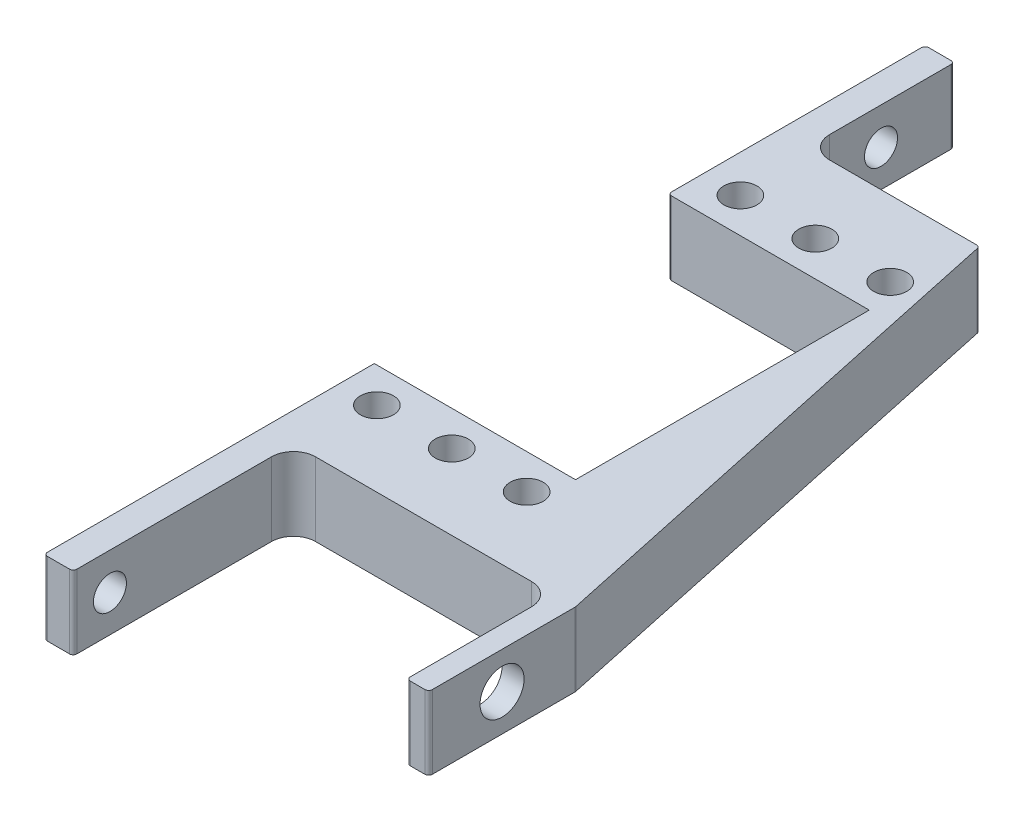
ISO-10303-21;
HEADER;
FILE_DESCRIPTION(('STEP AP214'),'2;1');
FILE_NAME('part.step','',(''),(''),'','','');
FILE_SCHEMA(('AUTOMOTIVE_DESIGN { 1 0 10303 214 1 1 1 1 }'));
ENDSEC;
DATA;
#1=APPLICATION_CONTEXT('core data for automotive mechanical design processes');
#2=APPLICATION_PROTOCOL_DEFINITION('international standard','automotive_design',2000,#1);
#3=PRODUCT_CONTEXT('',#1,'mechanical');
#4=PRODUCT('Part','Part','',(#3));
#5=PRODUCT_RELATED_PRODUCT_CATEGORY('part','',(#4));
#6=PRODUCT_DEFINITION_FORMATION('','',#4);
#7=PRODUCT_DEFINITION_CONTEXT('part definition',#1,'design');
#8=PRODUCT_DEFINITION('design','',#6,#7);
#9=PRODUCT_DEFINITION_SHAPE('','',#8);
#10=(LENGTH_UNIT() NAMED_UNIT(*) SI_UNIT(.MILLI.,.METRE.));
#11=(NAMED_UNIT(*) PLANE_ANGLE_UNIT() SI_UNIT($,.RADIAN.));
#12=(NAMED_UNIT(*) SI_UNIT($,.STERADIAN.) SOLID_ANGLE_UNIT());
#13=UNCERTAINTY_MEASURE_WITH_UNIT(LENGTH_MEASURE(1.E-05),#10,'distance_accuracy_value','');
#14=(GEOMETRIC_REPRESENTATION_CONTEXT(3) GLOBAL_UNCERTAINTY_ASSIGNED_CONTEXT((#13)) GLOBAL_UNIT_ASSIGNED_CONTEXT((#10,
#11,#12)) REPRESENTATION_CONTEXT('',''));
#15=CARTESIAN_POINT('',(0.,0.,0.));
#16=DIRECTION('',(0.,0.,1.));
#17=DIRECTION('',(1.,0.,0.));
#18=AXIS2_PLACEMENT_3D('',#15,#16,#17);
#19=CARTESIAN_POINT('',(0.,10.,0.));
#20=DIRECTION('',(0.,0.,-1.));
#21=DIRECTION('',(-1.,0.,0.));
#22=AXIS2_PLACEMENT_3D('',#19,#20,#21);
#23=PLANE('',#22);
#24=DIRECTION('',(1.,0.,0.));
#25=VECTOR('',#24,1.);
#26=CARTESIAN_POINT('',(0.,0.,0.));
#27=LINE('',#26,#25);
#28=CARTESIAN_POINT('',(12.5,0.,0.));
#29=VERTEX_POINT('',#28);
#30=CARTESIAN_POINT('',(14.5,0.,0.));
#31=VERTEX_POINT('',#30);
#32=EDGE_CURVE('E271',#29,#31,#27,.T.);
#33=ORIENTED_EDGE('',*,*,#32,.T.);
#34=DIRECTION('',(0.,-1.,0.));
#35=VECTOR('',#34,1.);
#36=CARTESIAN_POINT('',(14.5,10.,0.));
#37=LINE('',#36,#35);
#38=CARTESIAN_POINT('',(14.5,10.,0.));
#39=VERTEX_POINT('',#38);
#40=EDGE_CURVE('E61',#31,#39,#37,.F.);
#41=ORIENTED_EDGE('',*,*,#40,.T.);
#42=DIRECTION('',(1.,0.,0.));
#43=VECTOR('',#42,1.);
#44=CARTESIAN_POINT('',(0.,10.,0.));
#45=LINE('',#44,#43);
#46=CARTESIAN_POINT('',(12.5,10.,0.));
#47=VERTEX_POINT('',#46);
#48=EDGE_CURVE('E306',#47,#39,#45,.T.);
#49=ORIENTED_EDGE('',*,*,#48,.F.);
#50=DIRECTION('',(0.,1.,0.));
#51=VECTOR('',#50,1.);
#52=CARTESIAN_POINT('',(12.5,0.,0.));
#53=LINE('',#52,#51);
#54=EDGE_CURVE('E489',#47,#29,#53,.F.);
#55=ORIENTED_EDGE('',*,*,#54,.T.);
#56=EDGE_LOOP('',(#33,#41,#49,#55));
#57=FACE_BOUND('',#56,.T.);
#58=ADVANCED_FACE('F45',(#57),#23,.F.);
#59=CARTESIAN_POINT('',(-27.4,10.,-20.0021199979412));
#60=DIRECTION('',(0.,0.,-1.));
#61=DIRECTION('',(-1.,0.,0.));
#62=AXIS2_PLACEMENT_3D('',#59,#60,#61);
#63=PLANE('',#62);
#64=DIRECTION('',(1.,0.,0.));
#65=VECTOR('',#64,1.);
#66=CARTESIAN_POINT('',(-27.4,0.,-20.0021199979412));
#67=LINE('',#66,#65);
#68=CARTESIAN_POINT('',(-20.4,0.,-20.0021199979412));
#69=VERTEX_POINT('',#68);
#70=CARTESIAN_POINT('',(8.99999999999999,0.,-20.0021199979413));
#71=VERTEX_POINT('',#70);
#72=EDGE_CURVE('E302',#69,#71,#67,.T.);
#73=ORIENTED_EDGE('',*,*,#72,.T.);
#74=DIRECTION('',(0.,-1.,0.));
#75=VECTOR('',#74,1.);
#76=CARTESIAN_POINT('',(9.,10.,-20.0021199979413));
#77=LINE('',#76,#75);
#78=CARTESIAN_POINT('',(8.99999999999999,10.,-20.0021199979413));
#79=VERTEX_POINT('',#78);
#80=EDGE_CURVE('E370',#71,#79,#77,.F.);
#81=ORIENTED_EDGE('',*,*,#80,.T.);
#82=DIRECTION('',(1.,0.,0.));
#83=VECTOR('',#82,1.);
#84=CARTESIAN_POINT('',(-27.4,10.,-20.0021199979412));
#85=LINE('',#84,#83);
#86=CARTESIAN_POINT('',(-20.4,10.,-20.0021199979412));
#87=VERTEX_POINT('',#86);
#88=EDGE_CURVE('E266',#87,#79,#85,.T.);
#89=ORIENTED_EDGE('',*,*,#88,.F.);
#90=DIRECTION('',(0.,1.,0.));
#91=VECTOR('',#90,1.);
#92=CARTESIAN_POINT('',(-20.4,0.,-20.0021199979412));
#93=LINE('',#92,#91);
#94=EDGE_CURVE('E367',#87,#69,#93,.F.);
#95=ORIENTED_EDGE('',*,*,#94,.T.);
#96=EDGE_LOOP('',(#73,#81,#89,#95));
#97=FACE_BOUND('',#96,.T.);
#98=ADVANCED_FACE('F595',(#97),#63,.F.);
#99=CARTESIAN_POINT('',(0.00562452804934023,10.,-90.0021199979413));
#100=DIRECTION('',(0.,0.,1.));
#101=DIRECTION('',(1.,0.,0.));
#102=AXIS2_PLACEMENT_3D('',#99,#100,#101);
#103=PLANE('',#102);
#104=DIRECTION('',(-1.,0.,0.));
#105=VECTOR('',#104,1.);
#106=CARTESIAN_POINT('',(0.00562452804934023,10.,-90.0021199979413));
#107=LINE('',#106,#105);
#108=CARTESIAN_POINT('',(-0.398617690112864,10.,-90.0021199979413));
#109=VERTEX_POINT('',#108);
#110=CARTESIAN_POINT('',(-20.4,10.,-90.0021199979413));
#111=VERTEX_POINT('',#110);
#112=EDGE_CURVE('E570',#109,#111,#107,.T.);
#113=ORIENTED_EDGE('',*,*,#112,.F.);
#114=DIRECTION('',(0.,-1.,0.));
#115=VECTOR('',#114,1.);
#116=CARTESIAN_POINT('',(-0.398617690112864,10.,-90.0021199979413));
#117=LINE('',#116,#115);
#118=CARTESIAN_POINT('',(-0.398617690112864,0.,-90.0021199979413));
#119=VERTEX_POINT('',#118);
#120=EDGE_CURVE('E465',#109,#119,#117,.T.);
#121=ORIENTED_EDGE('',*,*,#120,.T.);
#122=DIRECTION('',(-1.,0.,0.));
#123=VECTOR('',#122,1.);
#124=CARTESIAN_POINT('',(0.00562452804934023,0.,-90.0021199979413));
#125=LINE('',#124,#123);
#126=CARTESIAN_POINT('',(-20.4,0.,-90.0021199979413));
#127=VERTEX_POINT('',#126);
#128=EDGE_CURVE('E283',#119,#127,#125,.T.);
#129=ORIENTED_EDGE('',*,*,#128,.T.);
#130=DIRECTION('',(0.,-1.,0.));
#131=VECTOR('',#130,1.);
#132=CARTESIAN_POINT('',(-20.4,10.,-90.0021199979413));
#133=LINE('',#132,#131);
#134=EDGE_CURVE('E359',#127,#111,#133,.F.);
#135=ORIENTED_EDGE('',*,*,#134,.T.);
#136=EDGE_LOOP('',(#113,#121,#129,#135));
#137=FACE_BOUND('',#136,.T.);
#138=ADVANCED_FACE('F602',(#137),#103,.F.);
#139=CARTESIAN_POINT('',(-22.3,-14.,-30.2521199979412));
#140=DIRECTION('',(0.,1.,0.));
#141=DIRECTION('',(0.,0.,1.));
#142=AXIS2_PLACEMENT_3D('',#139,#140,#141);
#143=CYLINDRICAL_SURFACE('',#142,2.25);
#144=CARTESIAN_POINT('',(-22.3,0.,-30.2521199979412));
#145=DIRECTION('',(0.,-1.,0.));
#146=DIRECTION('',(0.,0.,-1.));
#147=AXIS2_PLACEMENT_3D('',#144,#145,#146);
#148=CIRCLE('',#147,2.25);
#149=CARTESIAN_POINT('',(-22.3,0.,-32.5021199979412));
#150=VERTEX_POINT('',#149);
#151=EDGE_CURVE('E249',#150,#150,#148,.T.);
#152=ORIENTED_EDGE('',*,*,#151,.T.);
#153=EDGE_LOOP('',(#152));
#154=FACE_BOUND('',#153,.T.);
#155=CARTESIAN_POINT('',(-22.3,10.,-30.2521199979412));
#156=DIRECTION('',(0.,1.,0.));
#157=DIRECTION('',(0.,0.,1.));
#158=AXIS2_PLACEMENT_3D('',#155,#156,#157);
#159=CIRCLE('',#158,2.25);
#160=CARTESIAN_POINT('',(-22.3,10.,-28.0021199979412));
#161=VERTEX_POINT('',#160);
#162=EDGE_CURVE('E319',#161,#161,#159,.T.);
#163=ORIENTED_EDGE('',*,*,#162,.T.);
#164=EDGE_LOOP('',(#163));
#165=FACE_BOUND('',#164,.T.);
#166=ADVANCED_FACE('F609',(#154,#165),#143,.F.);
#167=CARTESIAN_POINT('',(15.,10.,0.));
#168=DIRECTION('',(-1.,0.,0.));
#169=DIRECTION('',(0.,0.,1.));
#170=AXIS2_PLACEMENT_3D('',#167,#168,#169);
#171=PLANE('',#170);
#172=CARTESIAN_POINT('',(15.,5.,-10.));
#173=DIRECTION('',(1.,0.,0.));
#174=DIRECTION('',(0.,0.,-1.));
#175=AXIS2_PLACEMENT_3D('',#172,#173,#174);
#176=CIRCLE('',#175,3.);
#177=CARTESIAN_POINT('',(15.,5.,-13.));
#178=VERTEX_POINT('',#177);
#179=EDGE_CURVE('E344',#178,#178,#176,.T.);
#180=ORIENTED_EDGE('',*,*,#179,.F.);
#181=EDGE_LOOP('',(#180));
#182=FACE_BOUND('',#181,.T.);
#183=DIRECTION('',(0.,0.,-1.));
#184=VECTOR('',#183,1.);
#185=CARTESIAN_POINT('',(15.,0.,0.));
#186=LINE('',#185,#184);
#187=CARTESIAN_POINT('',(15.,0.,-0.5));
#188=VERTEX_POINT('',#187);
#189=CARTESIAN_POINT('',(15.,0.,-19.9470508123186));
#190=VERTEX_POINT('',#189);
#191=EDGE_CURVE('E274',#188,#190,#186,.T.);
#192=ORIENTED_EDGE('',*,*,#191,.T.);
#193=DIRECTION('',(0.,-1.,0.));
#194=VECTOR('',#193,1.);
#195=CARTESIAN_POINT('',(15.,10.,-19.9470508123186));
#196=LINE('',#195,#194);
#197=CARTESIAN_POINT('',(15.,10.,-19.9470508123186));
#198=VERTEX_POINT('',#197);
#199=EDGE_CURVE('E437',#190,#198,#196,.F.);
#200=ORIENTED_EDGE('',*,*,#199,.T.);
#201=DIRECTION('',(0.,0.,-1.));
#202=VECTOR('',#201,1.);
#203=CARTESIAN_POINT('',(15.,10.,0.));
#204=LINE('',#203,#202);
#205=CARTESIAN_POINT('',(15.,10.,-0.5));
#206=VERTEX_POINT('',#205);
#207=EDGE_CURVE('E563',#206,#198,#204,.T.);
#208=ORIENTED_EDGE('',*,*,#207,.F.);
#209=DIRECTION('',(0.,-1.,0.));
#210=VECTOR('',#209,1.);
#211=CARTESIAN_POINT('',(15.,10.,-0.5));
#212=LINE('',#211,#210);
#213=EDGE_CURVE('E433',#206,#188,#212,.T.);
#214=ORIENTED_EDGE('',*,*,#213,.T.);
#215=EDGE_LOOP('',(#192,#200,#208,#214));
#216=FACE_BOUND('',#215,.T.);
#217=ADVANCED_FACE('F607',(#182,#216),#171,.F.);
#218=CARTESIAN_POINT('',(15.,10.,-20.));
#219=DIRECTION('',(-0.97781980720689,0.,0.209447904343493));
#220=DIRECTION('',(0.209447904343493,0.,0.97781980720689));
#221=AXIS2_PLACEMENT_3D('',#218,#219,#220);
#222=PLANE('',#221);
#223=DIRECTION('',(-0.209447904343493,0.,-0.97781980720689));
#224=VECTOR('',#223,1.);
#225=CARTESIAN_POINT('',(15.,10.,-20.));
#226=LINE('',#225,#224);
#227=CARTESIAN_POINT('',(14.9889099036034,10.,-20.0517747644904));
#228=VERTEX_POINT('',#227);
#229=CARTESIAN_POINT('',(0.0902922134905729,10.,-89.606843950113));
#230=VERTEX_POINT('',#229);
#231=EDGE_CURVE('E566',#228,#230,#226,.T.);
#232=ORIENTED_EDGE('',*,*,#231,.F.);
#233=DIRECTION('',(0.,-1.,0.));
#234=VECTOR('',#233,1.);
#235=CARTESIAN_POINT('',(14.9889099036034,10.,-20.0517747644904));
#236=LINE('',#235,#234);
#237=CARTESIAN_POINT('',(14.9889099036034,0.,-20.0517747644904));
#238=VERTEX_POINT('',#237);
#239=EDGE_CURVE('E402',#228,#238,#236,.T.);
#240=ORIENTED_EDGE('',*,*,#239,.T.);
#241=DIRECTION('',(-0.209447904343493,0.,-0.97781980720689));
#242=VECTOR('',#241,1.);
#243=CARTESIAN_POINT('',(15.,0.,-20.));
#244=LINE('',#243,#242);
#245=CARTESIAN_POINT('',(0.0902922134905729,0.,-89.606843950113));
#246=VERTEX_POINT('',#245);
#247=EDGE_CURVE('E279',#238,#246,#244,.T.);
#248=ORIENTED_EDGE('',*,*,#247,.T.);
#249=DIRECTION('',(0.,-1.,0.));
#250=VECTOR('',#249,1.);
#251=CARTESIAN_POINT('',(0.0902922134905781,10.,-89.606843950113));
#252=LINE('',#251,#250);
#253=EDGE_CURVE('E399',#246,#230,#252,.F.);
#254=ORIENTED_EDGE('',*,*,#253,.T.);
#255=EDGE_LOOP('',(#232,#240,#248,#254));
#256=FACE_BOUND('',#255,.T.);
#257=ADVANCED_FACE('F955',(#256),#222,.F.);
#258=CARTESIAN_POINT('',(-27.4,10.,-90.0021199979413));
#259=DIRECTION('',(1.,0.,0.));
#260=DIRECTION('',(0.,0.,-1.));
#261=AXIS2_PLACEMENT_3D('',#258,#259,#260);
#262=PLANE('',#261);
#263=CARTESIAN_POINT('',(-27.4,5.00000000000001,-100.002119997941));
#264=DIRECTION('',(1.,0.,0.));
#265=DIRECTION('',(0.,0.,-1.));
#266=AXIS2_PLACEMENT_3D('',#263,#264,#265);
#267=CIRCLE('',#266,2.25);
#268=CARTESIAN_POINT('',(-27.4,5.00000000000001,-102.252119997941));
#269=VERTEX_POINT('',#268);
#270=EDGE_CURVE('E533',#269,#269,#267,.T.);
#271=ORIENTED_EDGE('',*,*,#270,.T.);
#272=EDGE_LOOP('',(#271));
#273=FACE_BOUND('',#272,.T.);
#274=DIRECTION('',(0.,0.,1.));
#275=VECTOR('',#274,1.);
#276=CARTESIAN_POINT('',(-27.4,10.,-90.0021199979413));
#277=LINE('',#276,#275);
#278=CARTESIAN_POINT('',(-27.4,10.,-109.502119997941));
#279=VERTEX_POINT('',#278);
#280=CARTESIAN_POINT('',(-27.4,10.,-75.5021199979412));
#281=VERTEX_POINT('',#280);
#282=EDGE_CURVE('E239',#279,#281,#277,.T.);
#283=ORIENTED_EDGE('',*,*,#282,.F.);
#284=DIRECTION('',(0.,1.,0.));
#285=VECTOR('',#284,1.);
#286=CARTESIAN_POINT('',(-27.4,10.,-109.502119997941));
#287=LINE('',#286,#285);
#288=CARTESIAN_POINT('',(-27.4,0.,-109.502119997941));
#289=VERTEX_POINT('',#288);
#290=EDGE_CURVE('E483',#279,#289,#287,.F.);
#291=ORIENTED_EDGE('',*,*,#290,.T.);
#292=DIRECTION('',(0.,0.,1.));
#293=VECTOR('',#292,1.);
#294=CARTESIAN_POINT('',(-27.4,0.,-90.0021199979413));
#295=LINE('',#294,#293);
#296=CARTESIAN_POINT('',(-27.4,0.,-75.5021199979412));
#297=VERTEX_POINT('',#296);
#298=EDGE_CURVE('E286',#289,#297,#295,.T.);
#299=ORIENTED_EDGE('',*,*,#298,.T.);
#300=DIRECTION('',(0.,-1.,0.));
#301=VECTOR('',#300,1.);
#302=CARTESIAN_POINT('',(-27.4,10.,-75.5021199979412));
#303=LINE('',#302,#301);
#304=EDGE_CURVE('E480',#297,#281,#303,.F.);
#305=ORIENTED_EDGE('',*,*,#304,.T.);
#306=EDGE_LOOP('',(#283,#291,#299,#305));
#307=FACE_BOUND('',#306,.T.);
#308=ADVANCED_FACE('F947',(#273,#307),#262,.F.);
#309=CARTESIAN_POINT('',(0.,10.,-75.0021199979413));
#310=DIRECTION('',(0.,0.,-1.));
#311=DIRECTION('',(-1.,0.,0.));
#312=AXIS2_PLACEMENT_3D('',#309,#310,#311);
#313=PLANE('',#312);
#314=DIRECTION('',(1.,0.,0.));
#315=VECTOR('',#314,1.);
#316=CARTESIAN_POINT('',(0.,10.,-75.0021199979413));
#317=LINE('',#316,#315);
#318=CARTESIAN_POINT('',(-26.9,10.,-75.0021199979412));
#319=VERTEX_POINT('',#318);
#320=CARTESIAN_POINT('',(0.,10.,-75.0021199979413));
#321=VERTEX_POINT('',#320);
#322=EDGE_CURVE('E224',#319,#321,#317,.T.);
#323=ORIENTED_EDGE('',*,*,#322,.F.);
#324=DIRECTION('',(0.,-1.,0.));
#325=VECTOR('',#324,1.);
#326=CARTESIAN_POINT('',(-26.9,10.,-75.0021199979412));
#327=LINE('',#326,#325);
#328=CARTESIAN_POINT('',(-26.9,0.,-75.0021199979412));
#329=VERTEX_POINT('',#328);
#330=EDGE_CURVE('E486',#319,#329,#327,.T.);
#331=ORIENTED_EDGE('',*,*,#330,.T.);
#332=DIRECTION('',(1.,0.,0.));
#333=VECTOR('',#332,1.);
#334=CARTESIAN_POINT('',(0.,0.,-75.0021199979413));
#335=LINE('',#334,#333);
#336=CARTESIAN_POINT('',(0.,0.,-75.0021199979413));
#337=VERTEX_POINT('',#336);
#338=EDGE_CURVE('E245',#329,#337,#335,.T.);
#339=ORIENTED_EDGE('',*,*,#338,.T.);
#340=DIRECTION('',(0.,-1.,0.));
#341=VECTOR('',#340,1.);
#342=CARTESIAN_POINT('',(0.,10.,-75.0021199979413));
#343=LINE('',#342,#341);
#344=EDGE_CURVE('E242',#321,#337,#343,.T.);
#345=ORIENTED_EDGE('',*,*,#344,.F.);
#346=EDGE_LOOP('',(#323,#331,#339,#345));
#347=FACE_BOUND('',#346,.T.);
#348=ADVANCED_FACE('F243',(#347),#313,.F.);
#349=CARTESIAN_POINT('',(0.,10.,-35.0021199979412));
#350=DIRECTION('',(1.,0.,0.));
#351=DIRECTION('',(0.,0.,-1.));
#352=AXIS2_PLACEMENT_3D('',#349,#350,#351);
#353=PLANE('',#352);
#354=DIRECTION('',(0.,0.,1.));
#355=VECTOR('',#354,1.);
#356=CARTESIAN_POINT('',(0.,0.,-35.0021199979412));
#357=LINE('',#356,#355);
#358=CARTESIAN_POINT('',(0.,0.,-35.0021199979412));
#359=VERTEX_POINT('',#358);
#360=EDGE_CURVE('E292',#337,#359,#357,.T.);
#361=ORIENTED_EDGE('',*,*,#360,.T.);
#362=DIRECTION('',(0.,-1.,0.));
#363=VECTOR('',#362,1.);
#364=CARTESIAN_POINT('',(0.,10.,-35.0021199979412));
#365=LINE('',#364,#363);
#366=CARTESIAN_POINT('',(0.,10.,-35.0021199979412));
#367=VERTEX_POINT('',#366);
#368=EDGE_CURVE('E250',#367,#359,#365,.T.);
#369=ORIENTED_EDGE('',*,*,#368,.F.);
#370=DIRECTION('',(0.,0.,1.));
#371=VECTOR('',#370,1.);
#372=CARTESIAN_POINT('',(0.,10.,-35.0021199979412));
#373=LINE('',#372,#371);
#374=EDGE_CURVE('E230',#321,#367,#373,.T.);
#375=ORIENTED_EDGE('',*,*,#374,.F.);
#376=ORIENTED_EDGE('',*,*,#344,.T.);
#377=EDGE_LOOP('',(#361,#369,#375,#376));
#378=FACE_BOUND('',#377,.T.);
#379=ADVANCED_FACE('F252',(#378),#353,.F.);
#380=CARTESIAN_POINT('',(0.,10.,-35.0021199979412));
#381=DIRECTION('',(0.,0.,1.));
#382=DIRECTION('',(1.,0.,0.));
#383=AXIS2_PLACEMENT_3D('',#380,#381,#382);
#384=PLANE('',#383);
#385=DIRECTION('',(-1.,0.,0.));
#386=VECTOR('',#385,1.);
#387=CARTESIAN_POINT('',(0.,0.,-35.0021199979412));
#388=LINE('',#387,#386);
#389=CARTESIAN_POINT('',(-27.4,0.,-35.0021199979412));
#390=VERTEX_POINT('',#389);
#391=EDGE_CURVE('E295',#359,#390,#388,.T.);
#392=ORIENTED_EDGE('',*,*,#391,.T.);
#393=DIRECTION('',(0.,-1.,0.));
#394=VECTOR('',#393,1.);
#395=CARTESIAN_POINT('',(-27.4,10.,-35.0021199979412));
#396=LINE('',#395,#394);
#397=CARTESIAN_POINT('',(-27.4,10.,-35.0021199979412));
#398=VERTEX_POINT('',#397);
#399=EDGE_CURVE('E270',#398,#390,#396,.T.);
#400=ORIENTED_EDGE('',*,*,#399,.F.);
#401=DIRECTION('',(-1.,0.,0.));
#402=VECTOR('',#401,1.);
#403=CARTESIAN_POINT('',(0.,10.,-35.0021199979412));
#404=LINE('',#403,#402);
#405=EDGE_CURVE('E256',#367,#398,#404,.T.);
#406=ORIENTED_EDGE('',*,*,#405,.F.);
#407=ORIENTED_EDGE('',*,*,#368,.T.);
#408=EDGE_LOOP('',(#392,#400,#406,#407));
#409=FACE_BOUND('',#408,.T.);
#410=ADVANCED_FACE('F583',(#409),#384,.F.);
#411=CARTESIAN_POINT('',(-27.4,10.,-35.0021199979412));
#412=DIRECTION('',(1.,0.,0.));
#413=DIRECTION('',(0.,0.,-1.));
#414=AXIS2_PLACEMENT_3D('',#411,#412,#413);
#415=PLANE('',#414);
#416=CARTESIAN_POINT('',(-27.4,5.,4.99894000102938));
#417=DIRECTION('',(1.,0.,0.));
#418=DIRECTION('',(0.,0.,-1.));
#419=AXIS2_PLACEMENT_3D('',#416,#417,#418);
#420=CIRCLE('',#419,2.25);
#421=CARTESIAN_POINT('',(-27.4,5.,2.74894000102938));
#422=VERTEX_POINT('',#421);
#423=EDGE_CURVE('E328',#422,#422,#420,.T.);
#424=ORIENTED_EDGE('',*,*,#423,.T.);
#425=EDGE_LOOP('',(#424));
#426=FACE_BOUND('',#425,.T.);
#427=DIRECTION('',(0.,0.,1.));
#428=VECTOR('',#427,1.);
#429=CARTESIAN_POINT('',(-27.4,0.,-35.0021199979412));
#430=LINE('',#429,#428);
#431=CARTESIAN_POINT('',(-27.4,0.,9.49788000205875));
#432=VERTEX_POINT('',#431);
#433=EDGE_CURVE('E298',#390,#432,#430,.T.);
#434=ORIENTED_EDGE('',*,*,#433,.T.);
#435=DIRECTION('',(0.,-1.,0.));
#436=VECTOR('',#435,1.);
#437=CARTESIAN_POINT('',(-27.4,10.,9.49788000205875));
#438=LINE('',#437,#436);
#439=CARTESIAN_POINT('',(-27.4,10.,9.49788000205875));
#440=VERTEX_POINT('',#439);
#441=EDGE_CURVE('E54',#432,#440,#438,.F.);
#442=ORIENTED_EDGE('',*,*,#441,.T.);
#443=DIRECTION('',(0.,0.,1.));
#444=VECTOR('',#443,1.);
#445=CARTESIAN_POINT('',(-27.4,10.,-35.0021199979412));
#446=LINE('',#445,#444);
#447=EDGE_CURVE('E259',#398,#440,#446,.T.);
#448=ORIENTED_EDGE('',*,*,#447,.F.);
#449=ORIENTED_EDGE('',*,*,#399,.T.);
#450=EDGE_LOOP('',(#434,#442,#448,#449));
#451=FACE_BOUND('',#450,.T.);
#452=ADVANCED_FACE('F508',(#426,#451),#415,.F.);
#453=CARTESIAN_POINT('',(0.,10.,0.));
#454=DIRECTION('',(0.,-1.,0.));
#455=DIRECTION('',(0.,0.,-1.));
#456=AXIS2_PLACEMENT_3D('',#453,#454,#455);
#457=PLANE('',#456);
#458=CARTESIAN_POINT('',(-12.1,10.,-79.7521199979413));
#459=DIRECTION('',(0.,-1.,0.));
#460=DIRECTION('',(0.,0.,-1.));
#461=AXIS2_PLACEMENT_3D('',#458,#459,#460);
#462=CIRCLE('',#461,2.25);
#463=CARTESIAN_POINT('',(-12.1,10.,-82.0021199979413));
#464=VERTEX_POINT('',#463);
#465=EDGE_CURVE('E335',#464,#464,#462,.T.);
#466=ORIENTED_EDGE('',*,*,#465,.T.);
#467=EDGE_LOOP('',(#466));
#468=FACE_BOUND('',#467,.T.);
#469=CARTESIAN_POINT('',(-22.3,10.,-79.7521199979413));
#470=DIRECTION('',(0.,-1.,0.));
#471=DIRECTION('',(0.,0.,-1.));
#472=AXIS2_PLACEMENT_3D('',#469,#470,#471);
#473=CIRCLE('',#472,2.25);
#474=CARTESIAN_POINT('',(-22.3,10.,-82.0021199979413));
#475=VERTEX_POINT('',#474);
#476=EDGE_CURVE('E680',#475,#475,#473,.T.);
#477=ORIENTED_EDGE('',*,*,#476,.T.);
#478=EDGE_LOOP('',(#477));
#479=FACE_BOUND('',#478,.T.);
#480=CARTESIAN_POINT('',(-1.90000000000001,10.,-79.7521199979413));
#481=DIRECTION('',(0.,-1.,0.));
#482=DIRECTION('',(0.,0.,-1.));
#483=AXIS2_PLACEMENT_3D('',#480,#481,#482);
#484=CIRCLE('',#483,2.25);
#485=CARTESIAN_POINT('',(-1.90000000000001,10.,-82.0021199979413));
#486=VERTEX_POINT('',#485);
#487=EDGE_CURVE('E329',#486,#486,#484,.T.);
#488=ORIENTED_EDGE('',*,*,#487,.T.);
#489=EDGE_LOOP('',(#488));
#490=FACE_BOUND('',#489,.T.);
#491=CARTESIAN_POINT('',(-12.1,10.,-30.2521199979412));
#492=DIRECTION('',(0.,1.,0.));
#493=DIRECTION('',(0.,0.,1.));
#494=AXIS2_PLACEMENT_3D('',#491,#492,#493);
#495=CIRCLE('',#494,2.25);
#496=CARTESIAN_POINT('',(-12.1,10.,-28.0021199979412));
#497=VERTEX_POINT('',#496);
#498=EDGE_CURVE('E554',#497,#497,#495,.T.);
#499=ORIENTED_EDGE('',*,*,#498,.F.);
#500=EDGE_LOOP('',(#499));
#501=FACE_BOUND('',#500,.T.);
#502=CARTESIAN_POINT('',(-1.9,10.,-30.2521199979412));
#503=DIRECTION('',(0.,1.,0.));
#504=DIRECTION('',(0.,0.,1.));
#505=AXIS2_PLACEMENT_3D('',#502,#503,#504);
#506=CIRCLE('',#505,2.25);
#507=CARTESIAN_POINT('',(-1.9,10.,-28.0021199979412));
#508=VERTEX_POINT('',#507);
#509=EDGE_CURVE('E315',#508,#508,#506,.T.);
#510=ORIENTED_EDGE('',*,*,#509,.F.);
#511=EDGE_LOOP('',(#510));
#512=FACE_BOUND('',#511,.T.);
#513=ORIENTED_EDGE('',*,*,#207,.T.);
#514=CARTESIAN_POINT('',(14.5,10.,-19.9470508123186));
#515=DIRECTION('',(0.,-1.,0.));
#516=DIRECTION('',(0.,0.,-1.));
#517=AXIS2_PLACEMENT_3D('',#514,#515,#516);
#518=CIRCLE('',#517,0.5);
#519=EDGE_CURVE('E462',#198,#228,#518,.F.);
#520=ORIENTED_EDGE('',*,*,#519,.T.);
#521=ORIENTED_EDGE('',*,*,#231,.T.);
#522=CARTESIAN_POINT('',(-0.398617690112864,10.,-89.5021199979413));
#523=DIRECTION('',(0.,-1.,0.));
#524=DIRECTION('',(0.,0.,-1.));
#525=AXIS2_PLACEMENT_3D('',#522,#523,#524);
#526=CIRCLE('',#525,0.5);
#527=EDGE_CURVE('E459',#230,#109,#526,.F.);
#528=ORIENTED_EDGE('',*,*,#527,.T.);
#529=ORIENTED_EDGE('',*,*,#112,.T.);
#530=CARTESIAN_POINT('',(-20.4,10.,-93.0021199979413));
#531=DIRECTION('',(0.,-1.,0.));
#532=DIRECTION('',(0.,0.,-1.));
#533=AXIS2_PLACEMENT_3D('',#530,#531,#532);
#534=CIRCLE('',#533,3.);
#535=CARTESIAN_POINT('',(-23.4,10.,-93.0021199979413));
#536=VERTEX_POINT('',#535);
#537=EDGE_CURVE('E381',#111,#536,#534,.T.);
#538=ORIENTED_EDGE('',*,*,#537,.T.);
#539=DIRECTION('',(0.,0.,1.));
#540=VECTOR('',#539,1.);
#541=CARTESIAN_POINT('',(-23.4,10.,-90.0021199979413));
#542=LINE('',#541,#540);
#543=CARTESIAN_POINT('',(-23.4,9.99999999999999,-109.502119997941));
#544=VERTEX_POINT('',#543);
#545=EDGE_CURVE('E355',#544,#536,#542,.T.);
#546=ORIENTED_EDGE('',*,*,#545,.F.);
#547=CARTESIAN_POINT('',(-23.9,10.,-109.502119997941));
#548=DIRECTION('',(0.,-1.,0.));
#549=DIRECTION('',(0.,0.,-1.));
#550=AXIS2_PLACEMENT_3D('',#547,#548,#549);
#551=CIRCLE('',#550,0.5);
#552=CARTESIAN_POINT('',(-23.9,10.,-110.002119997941));
#553=VERTEX_POINT('',#552);
#554=EDGE_CURVE('E456',#544,#553,#551,.F.);
#555=ORIENTED_EDGE('',*,*,#554,.T.);
#556=DIRECTION('',(1.,0.,0.));
#557=VECTOR('',#556,1.);
#558=CARTESIAN_POINT('',(-27.4,10.,-110.002119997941));
#559=LINE('',#558,#557);
#560=CARTESIAN_POINT('',(-26.9,10.,-110.002119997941));
#561=VERTEX_POINT('',#560);
#562=EDGE_CURVE('E542',#561,#553,#559,.T.);
#563=ORIENTED_EDGE('',*,*,#562,.F.);
#564=CARTESIAN_POINT('',(-26.9,10.,-109.502119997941));
#565=DIRECTION('',(0.,-1.,0.));
#566=DIRECTION('',(0.,0.,-1.));
#567=AXIS2_PLACEMENT_3D('',#564,#565,#566);
#568=CIRCLE('',#567,0.5);
#569=EDGE_CURVE('E453',#561,#279,#568,.F.);
#570=ORIENTED_EDGE('',*,*,#569,.T.);
#571=ORIENTED_EDGE('',*,*,#282,.T.);
#572=CARTESIAN_POINT('',(-26.9,10.,-75.5021199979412));
#573=DIRECTION('',(0.,-1.,0.));
#574=DIRECTION('',(0.,0.,-1.));
#575=AXIS2_PLACEMENT_3D('',#572,#573,#574);
#576=CIRCLE('',#575,0.5);
#577=EDGE_CURVE('E234',#281,#319,#576,.F.);
#578=ORIENTED_EDGE('',*,*,#577,.T.);
#579=ORIENTED_EDGE('',*,*,#322,.T.);
#580=ORIENTED_EDGE('',*,*,#374,.T.);
#581=ORIENTED_EDGE('',*,*,#405,.T.);
#582=ORIENTED_EDGE('',*,*,#447,.T.);
#583=CARTESIAN_POINT('',(-26.9,10.,9.49788000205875));
#584=DIRECTION('',(0.,-1.,0.));
#585=DIRECTION('',(0.,0.,-1.));
#586=AXIS2_PLACEMENT_3D('',#583,#584,#585);
#587=CIRCLE('',#586,0.5);
#588=CARTESIAN_POINT('',(-26.9,10.,9.99788000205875));
#589=VERTEX_POINT('',#588);
#590=EDGE_CURVE('E443',#440,#589,#587,.F.);
#591=ORIENTED_EDGE('',*,*,#590,.T.);
#592=DIRECTION('',(-1.,0.,0.));
#593=VECTOR('',#592,1.);
#594=CARTESIAN_POINT('',(-27.4,10.,9.99788000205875));
#595=LINE('',#594,#593);
#596=CARTESIAN_POINT('',(-23.9,10.,9.99788000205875));
#597=VERTEX_POINT('',#596);
#598=EDGE_CURVE('E523',#597,#589,#595,.T.);
#599=ORIENTED_EDGE('',*,*,#598,.F.);
#600=CARTESIAN_POINT('',(-23.9,10.,9.49788000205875));
#601=DIRECTION('',(0.,-1.,0.));
#602=DIRECTION('',(0.,0.,-1.));
#603=AXIS2_PLACEMENT_3D('',#600,#601,#602);
#604=CIRCLE('',#603,0.5);
#605=CARTESIAN_POINT('',(-23.4,10.,9.49788000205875));
#606=VERTEX_POINT('',#605);
#607=EDGE_CURVE('E440',#597,#606,#604,.F.);
#608=ORIENTED_EDGE('',*,*,#607,.T.);
#609=DIRECTION('',(0.,0.,1.));
#610=VECTOR('',#609,1.);
#611=CARTESIAN_POINT('',(-23.4,10.,9.99788000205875));
#612=LINE('',#611,#610);
#613=CARTESIAN_POINT('',(-23.4,10.,-17.0021199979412));
#614=VERTEX_POINT('',#613);
#615=EDGE_CURVE('E349',#614,#606,#612,.T.);
#616=ORIENTED_EDGE('',*,*,#615,.F.);
#617=CARTESIAN_POINT('',(-20.4,10.,-17.0021199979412));
#618=DIRECTION('',(0.,-1.,0.));
#619=DIRECTION('',(0.,0.,-1.));
#620=AXIS2_PLACEMENT_3D('',#617,#618,#619);
#621=CIRCLE('',#620,3.);
#622=EDGE_CURVE('E392',#614,#87,#621,.T.);
#623=ORIENTED_EDGE('',*,*,#622,.T.);
#624=ORIENTED_EDGE('',*,*,#88,.T.);
#625=CARTESIAN_POINT('',(9.,10.,-17.0021199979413));
#626=DIRECTION('',(0.,-1.,0.));
#627=DIRECTION('',(0.,0.,-1.));
#628=AXIS2_PLACEMENT_3D('',#625,#626,#627);
#629=CIRCLE('',#628,3.);
#630=CARTESIAN_POINT('',(12.,10.,-17.0021199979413));
#631=VERTEX_POINT('',#630);
#632=EDGE_CURVE('E388',#79,#631,#629,.T.);
#633=ORIENTED_EDGE('',*,*,#632,.T.);
#634=DIRECTION('',(0.,0.,-1.));
#635=VECTOR('',#634,1.);
#636=CARTESIAN_POINT('',(12.,10.,0.));
#637=LINE('',#636,#635);
#638=CARTESIAN_POINT('',(12.,10.,-0.5));
#639=VERTEX_POINT('',#638);
#640=EDGE_CURVE('E343',#639,#631,#637,.T.);
#641=ORIENTED_EDGE('',*,*,#640,.F.);
#642=CARTESIAN_POINT('',(12.5,10.,-0.5));
#643=DIRECTION('',(0.,-1.,0.));
#644=DIRECTION('',(0.,0.,-1.));
#645=AXIS2_PLACEMENT_3D('',#642,#643,#644);
#646=CIRCLE('',#645,0.5);
#647=EDGE_CURVE('E68',#639,#47,#646,.F.);
#648=ORIENTED_EDGE('',*,*,#647,.T.);
#649=ORIENTED_EDGE('',*,*,#48,.T.);
#650=CARTESIAN_POINT('',(14.5,10.,-0.5));
#651=DIRECTION('',(0.,-1.,0.));
#652=DIRECTION('',(0.,0.,-1.));
#653=AXIS2_PLACEMENT_3D('',#650,#651,#652);
#654=CIRCLE('',#653,0.5);
#655=EDGE_CURVE('E448',#39,#206,#654,.F.);
#656=ORIENTED_EDGE('',*,*,#655,.T.);
#657=EDGE_LOOP('',(#513,#520,#521,#528,#529,#538,#546,#555,#563,#570,#571,#578,#579,#580,#581,
#582,#591,#599,#608,#616,#623,#624,#633,#641,#648,#649,#656));
#658=FACE_BOUND('',#657,.T.);
#659=ORIENTED_EDGE('',*,*,#162,.F.);
#660=EDGE_LOOP('',(#659));
#661=FACE_BOUND('',#660,.T.);
#662=ADVANCED_FACE('F227',(#468,#479,#490,#501,#512,#658,#661),#457,.F.);
#663=CARTESIAN_POINT('',(0.,0.,0.));
#664=DIRECTION('',(0.,-1.,0.));
#665=DIRECTION('',(0.,0.,-1.));
#666=AXIS2_PLACEMENT_3D('',#663,#664,#665);
#667=PLANE('',#666);
#668=ORIENTED_EDGE('',*,*,#247,.F.);
#669=CARTESIAN_POINT('',(14.5,0.,-19.9470508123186));
#670=DIRECTION('',(0.,-1.,0.));
#671=DIRECTION('',(0.,0.,-1.));
#672=AXIS2_PLACEMENT_3D('',#669,#670,#671);
#673=CIRCLE('',#672,0.5);
#674=EDGE_CURVE('E430',#238,#190,#673,.T.);
#675=ORIENTED_EDGE('',*,*,#674,.T.);
#676=ORIENTED_EDGE('',*,*,#191,.F.);
#677=CARTESIAN_POINT('',(14.5,0.,-0.5));
#678=DIRECTION('',(0.,-1.,0.));
#679=DIRECTION('',(0.,0.,-1.));
#680=AXIS2_PLACEMENT_3D('',#677,#678,#679);
#681=CIRCLE('',#680,0.5);
#682=EDGE_CURVE('E415',#188,#31,#681,.T.);
#683=ORIENTED_EDGE('',*,*,#682,.T.);
#684=ORIENTED_EDGE('',*,*,#32,.F.);
#685=CARTESIAN_POINT('',(12.5,0.,-0.5));
#686=DIRECTION('',(0.,-1.,0.));
#687=DIRECTION('',(0.,0.,-1.));
#688=AXIS2_PLACEMENT_3D('',#685,#686,#687);
#689=CIRCLE('',#688,0.5);
#690=CARTESIAN_POINT('',(12.,0.,-0.5));
#691=VERTEX_POINT('',#690);
#692=EDGE_CURVE('E412',#29,#691,#689,.T.);
#693=ORIENTED_EDGE('',*,*,#692,.T.);
#694=DIRECTION('',(0.,0.,1.));
#695=VECTOR('',#694,1.);
#696=CARTESIAN_POINT('',(12.,0.,-20.0021199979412));
#697=LINE('',#696,#695);
#698=CARTESIAN_POINT('',(12.,0.,-17.0021199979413));
#699=VERTEX_POINT('',#698);
#700=EDGE_CURVE('E676',#699,#691,#697,.T.);
#701=ORIENTED_EDGE('',*,*,#700,.F.);
#702=CARTESIAN_POINT('',(9.,0.,-17.0021199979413));
#703=DIRECTION('',(0.,-1.,0.));
#704=DIRECTION('',(0.,0.,-1.));
#705=AXIS2_PLACEMENT_3D('',#702,#703,#704);
#706=CIRCLE('',#705,3.);
#707=EDGE_CURVE('E385',#699,#71,#706,.F.);
#708=ORIENTED_EDGE('',*,*,#707,.T.);
#709=ORIENTED_EDGE('',*,*,#72,.F.);
#710=CARTESIAN_POINT('',(-20.4,0.,-17.0021199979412));
#711=DIRECTION('',(0.,-1.,0.));
#712=DIRECTION('',(0.,0.,-1.));
#713=AXIS2_PLACEMENT_3D('',#710,#711,#712);
#714=CIRCLE('',#713,3.);
#715=CARTESIAN_POINT('',(-23.4,0.,-17.0021199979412));
#716=VERTEX_POINT('',#715);
#717=EDGE_CURVE('E395',#69,#716,#714,.F.);
#718=ORIENTED_EDGE('',*,*,#717,.T.);
#719=DIRECTION('',(0.,0.,-1.));
#720=VECTOR('',#719,1.);
#721=CARTESIAN_POINT('',(-23.4,0.,-20.0021199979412));
#722=LINE('',#721,#720);
#723=CARTESIAN_POINT('',(-23.4,0.,9.49788000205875));
#724=VERTEX_POINT('',#723);
#725=EDGE_CURVE('E354',#724,#716,#722,.T.);
#726=ORIENTED_EDGE('',*,*,#725,.F.);
#727=CARTESIAN_POINT('',(-23.9,0.,9.49788000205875));
#728=DIRECTION('',(0.,-1.,0.));
#729=DIRECTION('',(0.,0.,-1.));
#730=AXIS2_PLACEMENT_3D('',#727,#728,#729);
#731=CIRCLE('',#730,0.5);
#732=CARTESIAN_POINT('',(-23.9,0.,9.99788000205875));
#733=VERTEX_POINT('',#732);
#734=EDGE_CURVE('E406',#724,#733,#731,.T.);
#735=ORIENTED_EDGE('',*,*,#734,.T.);
#736=DIRECTION('',(1.,0.,0.));
#737=VECTOR('',#736,1.);
#738=CARTESIAN_POINT('',(-27.4,0.,9.99788000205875));
#739=LINE('',#738,#737);
#740=CARTESIAN_POINT('',(-26.9,0.,9.99788000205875));
#741=VERTEX_POINT('',#740);
#742=EDGE_CURVE('E521',#741,#733,#739,.T.);
#743=ORIENTED_EDGE('',*,*,#742,.F.);
#744=CARTESIAN_POINT('',(-26.9,0.,9.49788000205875));
#745=DIRECTION('',(0.,-1.,0.));
#746=DIRECTION('',(0.,0.,-1.));
#747=AXIS2_PLACEMENT_3D('',#744,#745,#746);
#748=CIRCLE('',#747,0.5);
#749=EDGE_CURVE('E409',#741,#432,#748,.T.);
#750=ORIENTED_EDGE('',*,*,#749,.T.);
#751=ORIENTED_EDGE('',*,*,#433,.F.);
#752=ORIENTED_EDGE('',*,*,#391,.F.);
#753=ORIENTED_EDGE('',*,*,#360,.F.);
#754=ORIENTED_EDGE('',*,*,#338,.F.);
#755=CARTESIAN_POINT('',(-26.9,0.,-75.5021199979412));
#756=DIRECTION('',(0.,-1.,0.));
#757=DIRECTION('',(0.,0.,-1.));
#758=AXIS2_PLACEMENT_3D('',#755,#756,#757);
#759=CIRCLE('',#758,0.5);
#760=EDGE_CURVE('E418',#329,#297,#759,.T.);
#761=ORIENTED_EDGE('',*,*,#760,.T.);
#762=ORIENTED_EDGE('',*,*,#298,.F.);
#763=CARTESIAN_POINT('',(-26.9,0.,-109.502119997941));
#764=DIRECTION('',(0.,-1.,0.));
#765=DIRECTION('',(0.,0.,-1.));
#766=AXIS2_PLACEMENT_3D('',#763,#764,#765);
#767=CIRCLE('',#766,0.5);
#768=CARTESIAN_POINT('',(-26.9,0.,-110.002119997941));
#769=VERTEX_POINT('',#768);
#770=EDGE_CURVE('E421',#289,#769,#767,.T.);
#771=ORIENTED_EDGE('',*,*,#770,.T.);
#772=DIRECTION('',(-1.,0.,0.));
#773=VECTOR('',#772,1.);
#774=CARTESIAN_POINT('',(-27.4,0.,-110.002119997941));
#775=LINE('',#774,#773);
#776=CARTESIAN_POINT('',(-23.9,0.,-110.002119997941));
#777=VERTEX_POINT('',#776);
#778=EDGE_CURVE('E546',#777,#769,#775,.T.);
#779=ORIENTED_EDGE('',*,*,#778,.F.);
#780=CARTESIAN_POINT('',(-23.9,0.,-109.502119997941));
#781=DIRECTION('',(0.,-1.,0.));
#782=DIRECTION('',(0.,0.,-1.));
#783=AXIS2_PLACEMENT_3D('',#780,#781,#782);
#784=CIRCLE('',#783,0.5);
#785=CARTESIAN_POINT('',(-23.4,0.,-109.502119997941));
#786=VERTEX_POINT('',#785);
#787=EDGE_CURVE('E424',#777,#786,#784,.T.);
#788=ORIENTED_EDGE('',*,*,#787,.T.);
#789=DIRECTION('',(0.,0.,-1.));
#790=VECTOR('',#789,1.);
#791=CARTESIAN_POINT('',(-23.4,0.,-110.002119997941));
#792=LINE('',#791,#790);
#793=CARTESIAN_POINT('',(-23.4,0.,-93.0021199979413));
#794=VERTEX_POINT('',#793);
#795=EDGE_CURVE('E1008',#794,#786,#792,.T.);
#796=ORIENTED_EDGE('',*,*,#795,.F.);
#797=CARTESIAN_POINT('',(-20.4,0.,-93.0021199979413));
#798=DIRECTION('',(0.,-1.,0.));
#799=DIRECTION('',(0.,0.,-1.));
#800=AXIS2_PLACEMENT_3D('',#797,#798,#799);
#801=CIRCLE('',#800,3.);
#802=EDGE_CURVE('E377',#794,#127,#801,.F.);
#803=ORIENTED_EDGE('',*,*,#802,.T.);
#804=ORIENTED_EDGE('',*,*,#128,.F.);
#805=CARTESIAN_POINT('',(-0.398617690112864,0.,-89.5021199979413));
#806=DIRECTION('',(0.,-1.,0.));
#807=DIRECTION('',(0.,0.,-1.));
#808=AXIS2_PLACEMENT_3D('',#805,#806,#807);
#809=CIRCLE('',#808,0.5);
#810=EDGE_CURVE('E427',#119,#246,#809,.T.);
#811=ORIENTED_EDGE('',*,*,#810,.T.);
#812=EDGE_LOOP('',(#668,#675,#676,#683,#684,#693,#701,#708,#709,#718,#726,#735,#743,#750,#751,
#752,#753,#754,#761,#762,#771,#779,#788,#796,#803,#804,#811));
#813=FACE_BOUND('',#812,.T.);
#814=CARTESIAN_POINT('',(-12.1,0.,-79.7521199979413));
#815=DIRECTION('',(0.,-1.,0.));
#816=DIRECTION('',(0.,0.,-1.));
#817=AXIS2_PLACEMENT_3D('',#814,#815,#816);
#818=CIRCLE('',#817,2.25);
#819=CARTESIAN_POINT('',(-12.1,0.,-82.0021199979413));
#820=VERTEX_POINT('',#819);
#821=EDGE_CURVE('E334',#820,#820,#818,.F.);
#822=ORIENTED_EDGE('',*,*,#821,.T.);
#823=EDGE_LOOP('',(#822));
#824=FACE_BOUND('',#823,.T.);
#825=CARTESIAN_POINT('',(-22.3,0.,-79.7521199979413));
#826=DIRECTION('',(0.,-1.,0.));
#827=DIRECTION('',(0.,0.,-1.));
#828=AXIS2_PLACEMENT_3D('',#825,#826,#827);
#829=CIRCLE('',#828,2.25);
#830=CARTESIAN_POINT('',(-22.3,0.,-82.0021199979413));
#831=VERTEX_POINT('',#830);
#832=EDGE_CURVE('E330',#831,#831,#829,.F.);
#833=ORIENTED_EDGE('',*,*,#832,.T.);
#834=EDGE_LOOP('',(#833));
#835=FACE_BOUND('',#834,.T.);
#836=CARTESIAN_POINT('',(-1.90000000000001,0.,-79.7521199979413));
#837=DIRECTION('',(0.,-1.,0.));
#838=DIRECTION('',(0.,0.,-1.));
#839=AXIS2_PLACEMENT_3D('',#836,#837,#838);
#840=CIRCLE('',#839,2.25);
#841=CARTESIAN_POINT('',(-1.90000000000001,0.,-82.0021199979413));
#842=VERTEX_POINT('',#841);
#843=EDGE_CURVE('E324',#842,#842,#840,.F.);
#844=ORIENTED_EDGE('',*,*,#843,.T.);
#845=EDGE_LOOP('',(#844));
#846=FACE_BOUND('',#845,.T.);
#847=CARTESIAN_POINT('',(-12.1,0.,-30.2521199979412));
#848=DIRECTION('',(0.,-1.,0.));
#849=DIRECTION('',(0.,0.,-1.));
#850=AXIS2_PLACEMENT_3D('',#847,#848,#849);
#851=CIRCLE('',#850,2.25);
#852=CARTESIAN_POINT('',(-12.1,0.,-32.5021199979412));
#853=VERTEX_POINT('',#852);
#854=EDGE_CURVE('E550',#853,#853,#851,.T.);
#855=ORIENTED_EDGE('',*,*,#854,.F.);
#856=EDGE_LOOP('',(#855));
#857=FACE_BOUND('',#856,.T.);
#858=CARTESIAN_POINT('',(-1.9,0.,-30.2521199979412));
#859=DIRECTION('',(0.,-1.,0.));
#860=DIRECTION('',(0.,0.,-1.));
#861=AXIS2_PLACEMENT_3D('',#858,#859,#860);
#862=CIRCLE('',#861,2.25);
#863=CARTESIAN_POINT('',(-1.9,0.,-32.5021199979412));
#864=VERTEX_POINT('',#863);
#865=EDGE_CURVE('E275',#864,#864,#862,.T.);
#866=ORIENTED_EDGE('',*,*,#865,.F.);
#867=EDGE_LOOP('',(#866));
#868=FACE_BOUND('',#867,.T.);
#869=ORIENTED_EDGE('',*,*,#151,.F.);
#870=EDGE_LOOP('',(#869));
#871=FACE_BOUND('',#870,.T.);
#872=ADVANCED_FACE('F526',(#813,#824,#835,#846,#857,#868,#871),#667,.T.);
#873=CARTESIAN_POINT('',(-1.9,-14.,-30.2521199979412));
#874=DIRECTION('',(0.,1.,0.));
#875=DIRECTION('',(0.,0.,1.));
#876=AXIS2_PLACEMENT_3D('',#873,#874,#875);
#877=CYLINDRICAL_SURFACE('',#876,2.25);
#878=ORIENTED_EDGE('',*,*,#865,.T.);
#879=EDGE_LOOP('',(#878));
#880=FACE_BOUND('',#879,.T.);
#881=ORIENTED_EDGE('',*,*,#509,.T.);
#882=EDGE_LOOP('',(#881));
#883=FACE_BOUND('',#882,.T.);
#884=ADVANCED_FACE('F723',(#880,#883),#877,.F.);
#885=CARTESIAN_POINT('',(-12.1,-14.,-30.2521199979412));
#886=DIRECTION('',(0.,1.,0.));
#887=DIRECTION('',(0.,0.,1.));
#888=AXIS2_PLACEMENT_3D('',#885,#886,#887);
#889=CYLINDRICAL_SURFACE('',#888,2.25);
#890=ORIENTED_EDGE('',*,*,#854,.T.);
#891=EDGE_LOOP('',(#890));
#892=FACE_BOUND('',#891,.T.);
#893=ORIENTED_EDGE('',*,*,#498,.T.);
#894=EDGE_LOOP('',(#893));
#895=FACE_BOUND('',#894,.T.);
#896=ADVANCED_FACE('F720',(#892,#895),#889,.F.);
#897=CARTESIAN_POINT('',(0.,0.,-110.002119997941));
#898=DIRECTION('',(0.,0.,1.));
#899=DIRECTION('',(1.,0.,0.));
#900=AXIS2_PLACEMENT_3D('',#897,#898,#899);
#901=PLANE('',#900);
#902=ORIENTED_EDGE('',*,*,#562,.T.);
#903=DIRECTION('',(0.,1.,0.));
#904=VECTOR('',#903,1.);
#905=CARTESIAN_POINT('',(-23.9,0.,-110.002119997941));
#906=LINE('',#905,#904);
#907=EDGE_CURVE('E477',#553,#777,#906,.F.);
#908=ORIENTED_EDGE('',*,*,#907,.T.);
#909=ORIENTED_EDGE('',*,*,#778,.T.);
#910=DIRECTION('',(0.,1.,0.));
#911=VECTOR('',#910,1.);
#912=CARTESIAN_POINT('',(-26.9,0.,-110.002119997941));
#913=LINE('',#912,#911);
#914=EDGE_CURVE('E473',#769,#561,#913,.T.);
#915=ORIENTED_EDGE('',*,*,#914,.T.);
#916=EDGE_LOOP('',(#902,#908,#909,#915));
#917=FACE_BOUND('',#916,.T.);
#918=ADVANCED_FACE('F716',(#917),#901,.F.);
#919=CARTESIAN_POINT('',(-35.4,5.,-100.002119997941));
#920=DIRECTION('',(1.,0.,0.));
#921=DIRECTION('',(0.,1.,0.));
#922=AXIS2_PLACEMENT_3D('',#919,#920,#921);
#923=CYLINDRICAL_SURFACE('',#922,2.25);
#924=CARTESIAN_POINT('',(-23.4,5.00000000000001,-100.002119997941));
#925=DIRECTION('',(-1.,0.,0.));
#926=DIRECTION('',(0.,-1.,0.));
#927=AXIS2_PLACEMENT_3D('',#924,#925,#926);
#928=CIRCLE('',#927,2.25);
#929=CARTESIAN_POINT('',(-23.4,2.75000000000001,-100.002119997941));
#930=VERTEX_POINT('',#929);
#931=EDGE_CURVE('E350',#930,#930,#928,.F.);
#932=ORIENTED_EDGE('',*,*,#931,.T.);
#933=EDGE_LOOP('',(#932));
#934=FACE_BOUND('',#933,.T.);
#935=ORIENTED_EDGE('',*,*,#270,.F.);
#936=EDGE_LOOP('',(#935));
#937=FACE_BOUND('',#936,.T.);
#938=ADVANCED_FACE('F713',(#934,#937),#923,.F.);
#939=CARTESIAN_POINT('',(0.,0.,9.99788000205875));
#940=DIRECTION('',(0.,0.,1.));
#941=DIRECTION('',(1.,0.,0.));
#942=AXIS2_PLACEMENT_3D('',#939,#940,#941);
#943=PLANE('',#942);
#944=ORIENTED_EDGE('',*,*,#598,.T.);
#945=DIRECTION('',(0.,-1.,0.));
#946=VECTOR('',#945,1.);
#947=CARTESIAN_POINT('',(-26.9,0.,9.99788000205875));
#948=LINE('',#947,#946);
#949=EDGE_CURVE('E501',#589,#741,#948,.T.);
#950=ORIENTED_EDGE('',*,*,#949,.T.);
#951=ORIENTED_EDGE('',*,*,#742,.T.);
#952=DIRECTION('',(0.,-1.,0.));
#953=VECTOR('',#952,1.);
#954=CARTESIAN_POINT('',(-23.9,10.,9.99788000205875));
#955=LINE('',#954,#953);
#956=EDGE_CURVE('E498',#733,#597,#955,.F.);
#957=ORIENTED_EDGE('',*,*,#956,.T.);
#958=EDGE_LOOP('',(#944,#950,#951,#957));
#959=FACE_BOUND('',#958,.T.);
#960=ADVANCED_FACE('F520',(#959),#943,.T.);
#961=CARTESIAN_POINT('',(-35.4,5.,4.99894000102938));
#962=DIRECTION('',(1.,0.,0.));
#963=DIRECTION('',(0.,0.,-1.));
#964=AXIS2_PLACEMENT_3D('',#961,#962,#963);
#965=CYLINDRICAL_SURFACE('',#964,2.25);
#966=CARTESIAN_POINT('',(-23.4,5.,4.99894000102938));
#967=DIRECTION('',(-1.,0.,0.));
#968=DIRECTION('',(0.,0.,1.));
#969=AXIS2_PLACEMENT_3D('',#966,#967,#968);
#970=CIRCLE('',#969,2.25);
#971=CARTESIAN_POINT('',(-23.4,5.,7.24894000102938));
#972=VERTEX_POINT('',#971);
#973=EDGE_CURVE('E345',#972,#972,#970,.F.);
#974=ORIENTED_EDGE('',*,*,#973,.T.);
#975=EDGE_LOOP('',(#974));
#976=FACE_BOUND('',#975,.T.);
#977=ORIENTED_EDGE('',*,*,#423,.F.);
#978=EDGE_LOOP('',(#977));
#979=FACE_BOUND('',#978,.T.);
#980=ADVANCED_FACE('F695',(#976,#979),#965,.F.);
#981=CARTESIAN_POINT('',(-1.90000000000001,-14.,-79.7521199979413));
#982=DIRECTION('',(0.,1.,0.));
#983=DIRECTION('',(0.,0.,1.));
#984=AXIS2_PLACEMENT_3D('',#981,#982,#983);
#985=CYLINDRICAL_SURFACE('',#984,2.25);
#986=ORIENTED_EDGE('',*,*,#843,.F.);
#987=EDGE_LOOP('',(#986));
#988=FACE_BOUND('',#987,.T.);
#989=ORIENTED_EDGE('',*,*,#487,.F.);
#990=EDGE_LOOP('',(#989));
#991=FACE_BOUND('',#990,.T.);
#992=ADVANCED_FACE('F692',(#988,#991),#985,.F.);
#993=CARTESIAN_POINT('',(-22.3,-14.,-79.7521199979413));
#994=DIRECTION('',(0.,1.,0.));
#995=DIRECTION('',(0.,0.,1.));
#996=AXIS2_PLACEMENT_3D('',#993,#994,#995);
#997=CYLINDRICAL_SURFACE('',#996,2.25);
#998=ORIENTED_EDGE('',*,*,#832,.F.);
#999=EDGE_LOOP('',(#998));
#1000=FACE_BOUND('',#999,.T.);
#1001=ORIENTED_EDGE('',*,*,#476,.F.);
#1002=EDGE_LOOP('',(#1001));
#1003=FACE_BOUND('',#1002,.T.);
#1004=ADVANCED_FACE('F694',(#1000,#1003),#997,.F.);
#1005=CARTESIAN_POINT('',(-12.1,-14.,-79.7521199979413));
#1006=DIRECTION('',(0.,1.,0.));
#1007=DIRECTION('',(0.,0.,1.));
#1008=AXIS2_PLACEMENT_3D('',#1005,#1006,#1007);
#1009=CYLINDRICAL_SURFACE('',#1008,2.25);
#1010=ORIENTED_EDGE('',*,*,#821,.F.);
#1011=EDGE_LOOP('',(#1010));
#1012=FACE_BOUND('',#1011,.T.);
#1013=ORIENTED_EDGE('',*,*,#465,.F.);
#1014=EDGE_LOOP('',(#1013));
#1015=FACE_BOUND('',#1014,.T.);
#1016=ADVANCED_FACE('F702',(#1012,#1015),#1009,.F.);
#1017=CARTESIAN_POINT('',(12.,0.,0.));
#1018=DIRECTION('',(-1.,0.,0.));
#1019=DIRECTION('',(0.,0.,1.));
#1020=AXIS2_PLACEMENT_3D('',#1017,#1018,#1019);
#1021=PLANE('',#1020);
#1022=CARTESIAN_POINT('',(12.,5.,-10.));
#1023=DIRECTION('',(-1.,0.,0.));
#1024=DIRECTION('',(0.,0.,1.));
#1025=AXIS2_PLACEMENT_3D('',#1022,#1023,#1024);
#1026=CIRCLE('',#1025,3.);
#1027=CARTESIAN_POINT('',(12.,5.,-7.));
#1028=VERTEX_POINT('',#1027);
#1029=EDGE_CURVE('E339',#1028,#1028,#1026,.T.);
#1030=ORIENTED_EDGE('',*,*,#1029,.F.);
#1031=EDGE_LOOP('',(#1030));
#1032=FACE_BOUND('',#1031,.T.);
#1033=ORIENTED_EDGE('',*,*,#700,.T.);
#1034=DIRECTION('',(0.,1.,0.));
#1035=VECTOR('',#1034,1.);
#1036=CARTESIAN_POINT('',(12.,10.,-0.5));
#1037=LINE('',#1036,#1035);
#1038=EDGE_CURVE('E494',#691,#639,#1037,.T.);
#1039=ORIENTED_EDGE('',*,*,#1038,.T.);
#1040=ORIENTED_EDGE('',*,*,#640,.T.);
#1041=DIRECTION('',(0.,-1.,0.));
#1042=VECTOR('',#1041,1.);
#1043=CARTESIAN_POINT('',(12.,0.,-17.0021199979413));
#1044=LINE('',#1043,#1042);
#1045=EDGE_CURVE('E363',#631,#699,#1044,.T.);
#1046=ORIENTED_EDGE('',*,*,#1045,.T.);
#1047=EDGE_LOOP('',(#1033,#1039,#1040,#1046));
#1048=FACE_BOUND('',#1047,.T.);
#1049=ADVANCED_FACE('F751',(#1032,#1048),#1021,.T.);
#1050=CARTESIAN_POINT('',(3.,5.,-10.));
#1051=DIRECTION('',(1.,0.,0.));
#1052=DIRECTION('',(0.,0.,-1.));
#1053=AXIS2_PLACEMENT_3D('',#1050,#1051,#1052);
#1054=CYLINDRICAL_SURFACE('',#1053,3.);
#1055=ORIENTED_EDGE('',*,*,#1029,.T.);
#1056=EDGE_LOOP('',(#1055));
#1057=FACE_BOUND('',#1056,.T.);
#1058=ORIENTED_EDGE('',*,*,#179,.T.);
#1059=EDGE_LOOP('',(#1058));
#1060=FACE_BOUND('',#1059,.T.);
#1061=ADVANCED_FACE('F755',(#1057,#1060),#1054,.F.);
#1062=CARTESIAN_POINT('',(-23.4,0.,0.));
#1063=DIRECTION('',(-1.,0.,0.));
#1064=DIRECTION('',(0.,0.,1.));
#1065=AXIS2_PLACEMENT_3D('',#1062,#1063,#1064);
#1066=PLANE('',#1065);
#1067=ORIENTED_EDGE('',*,*,#615,.T.);
#1068=DIRECTION('',(0.,-1.,0.));
#1069=VECTOR('',#1068,1.);
#1070=CARTESIAN_POINT('',(-23.4,0.,9.49788000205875));
#1071=LINE('',#1070,#1069);
#1072=EDGE_CURVE('E11',#606,#724,#1071,.T.);
#1073=ORIENTED_EDGE('',*,*,#1072,.T.);
#1074=ORIENTED_EDGE('',*,*,#725,.T.);
#1075=DIRECTION('',(0.,1.,0.));
#1076=VECTOR('',#1075,1.);
#1077=CARTESIAN_POINT('',(-23.4,10.,-17.0021199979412));
#1078=LINE('',#1077,#1076);
#1079=EDGE_CURVE('E373',#716,#614,#1078,.T.);
#1080=ORIENTED_EDGE('',*,*,#1079,.T.);
#1081=EDGE_LOOP('',(#1067,#1073,#1074,#1080));
#1082=FACE_BOUND('',#1081,.T.);
#1083=ORIENTED_EDGE('',*,*,#973,.F.);
#1084=EDGE_LOOP('',(#1083));
#1085=FACE_BOUND('',#1084,.T.);
#1086=ADVANCED_FACE('F662',(#1082,#1085),#1066,.F.);
#1087=CARTESIAN_POINT('',(-23.4,0.,0.));
#1088=DIRECTION('',(-1.,0.,0.));
#1089=DIRECTION('',(0.,-1.,0.));
#1090=AXIS2_PLACEMENT_3D('',#1087,#1088,#1089);
#1091=PLANE('',#1090);
#1092=ORIENTED_EDGE('',*,*,#795,.T.);
#1093=DIRECTION('',(0.,1.,0.));
#1094=VECTOR('',#1093,1.);
#1095=CARTESIAN_POINT('',(-23.4,0.,-109.502119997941));
#1096=LINE('',#1095,#1094);
#1097=EDGE_CURVE('E469',#786,#544,#1096,.T.);
#1098=ORIENTED_EDGE('',*,*,#1097,.T.);
#1099=ORIENTED_EDGE('',*,*,#545,.T.);
#1100=DIRECTION('',(0.,-1.,0.));
#1101=VECTOR('',#1100,1.);
#1102=CARTESIAN_POINT('',(-23.4,0.,-93.0021199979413));
#1103=LINE('',#1102,#1101);
#1104=EDGE_CURVE('E323',#536,#794,#1103,.T.);
#1105=ORIENTED_EDGE('',*,*,#1104,.T.);
#1106=EDGE_LOOP('',(#1092,#1098,#1099,#1105));
#1107=FACE_BOUND('',#1106,.T.);
#1108=ORIENTED_EDGE('',*,*,#931,.F.);
#1109=EDGE_LOOP('',(#1108));
#1110=FACE_BOUND('',#1109,.T.);
#1111=ADVANCED_FACE('F617',(#1107,#1110),#1091,.F.);
#1112=CARTESIAN_POINT('',(-20.4,0.,-93.0021199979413));
#1113=DIRECTION('',(0.,1.,0.));
#1114=DIRECTION('',(-1.,0.,0.));
#1115=AXIS2_PLACEMENT_3D('',#1112,#1113,#1114);
#1116=CYLINDRICAL_SURFACE('',#1115,3.);
#1117=ORIENTED_EDGE('',*,*,#537,.F.);
#1118=ORIENTED_EDGE('',*,*,#134,.F.);
#1119=ORIENTED_EDGE('',*,*,#802,.F.);
#1120=ORIENTED_EDGE('',*,*,#1104,.F.);
#1121=EDGE_LOOP('',(#1117,#1118,#1119,#1120));
#1122=FACE_BOUND('',#1121,.T.);
#1123=ADVANCED_FACE('F613',(#1122),#1116,.F.);
#1124=CARTESIAN_POINT('',(9.,0.,-17.0021199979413));
#1125=DIRECTION('',(0.,-1.,0.));
#1126=DIRECTION('',(0.,0.,-1.));
#1127=AXIS2_PLACEMENT_3D('',#1124,#1125,#1126);
#1128=CYLINDRICAL_SURFACE('',#1127,3.);
#1129=ORIENTED_EDGE('',*,*,#632,.F.);
#1130=ORIENTED_EDGE('',*,*,#80,.F.);
#1131=ORIENTED_EDGE('',*,*,#707,.F.);
#1132=ORIENTED_EDGE('',*,*,#1045,.F.);
#1133=EDGE_LOOP('',(#1129,#1130,#1131,#1132));
#1134=FACE_BOUND('',#1133,.T.);
#1135=ADVANCED_FACE('F616',(#1134),#1128,.F.);
#1136=CARTESIAN_POINT('',(-20.4,0.,-17.0021199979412));
#1137=DIRECTION('',(0.,-1.,0.));
#1138=DIRECTION('',(0.,0.,-1.));
#1139=AXIS2_PLACEMENT_3D('',#1136,#1137,#1138);
#1140=CYLINDRICAL_SURFACE('',#1139,3.);
#1141=ORIENTED_EDGE('',*,*,#717,.F.);
#1142=ORIENTED_EDGE('',*,*,#94,.F.);
#1143=ORIENTED_EDGE('',*,*,#622,.F.);
#1144=ORIENTED_EDGE('',*,*,#1079,.F.);
#1145=EDGE_LOOP('',(#1141,#1142,#1143,#1144));
#1146=FACE_BOUND('',#1145,.T.);
#1147=ADVANCED_FACE('F621',(#1146),#1140,.F.);
#1148=CARTESIAN_POINT('',(14.5,10.,-19.9470508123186));
#1149=DIRECTION('',(0.,-1.,0.));
#1150=DIRECTION('',(0.,0.,-1.));
#1151=AXIS2_PLACEMENT_3D('',#1148,#1149,#1150);
#1152=CYLINDRICAL_SURFACE('',#1151,0.5);
#1153=ORIENTED_EDGE('',*,*,#519,.F.);
#1154=ORIENTED_EDGE('',*,*,#199,.F.);
#1155=ORIENTED_EDGE('',*,*,#674,.F.);
#1156=ORIENTED_EDGE('',*,*,#239,.F.);
#1157=EDGE_LOOP('',(#1153,#1154,#1155,#1156));
#1158=FACE_BOUND('',#1157,.T.);
#1159=ADVANCED_FACE('F624',(#1158),#1152,.T.);
#1160=CARTESIAN_POINT('',(-0.398617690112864,10.,-89.5021199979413));
#1161=DIRECTION('',(0.,-1.,0.));
#1162=DIRECTION('',(0.,0.,-1.));
#1163=AXIS2_PLACEMENT_3D('',#1160,#1161,#1162);
#1164=CYLINDRICAL_SURFACE('',#1163,0.5);
#1165=ORIENTED_EDGE('',*,*,#527,.F.);
#1166=ORIENTED_EDGE('',*,*,#253,.F.);
#1167=ORIENTED_EDGE('',*,*,#810,.F.);
#1168=ORIENTED_EDGE('',*,*,#120,.F.);
#1169=EDGE_LOOP('',(#1165,#1166,#1167,#1168));
#1170=FACE_BOUND('',#1169,.T.);
#1171=ADVANCED_FACE('F628',(#1170),#1164,.T.);
#1172=CARTESIAN_POINT('',(-23.9,0.,-109.502119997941));
#1173=DIRECTION('',(0.,1.,0.));
#1174=DIRECTION('',(-1.,0.,0.));
#1175=AXIS2_PLACEMENT_3D('',#1172,#1173,#1174);
#1176=CYLINDRICAL_SURFACE('',#1175,0.5);
#1177=ORIENTED_EDGE('',*,*,#787,.F.);
#1178=ORIENTED_EDGE('',*,*,#907,.F.);
#1179=ORIENTED_EDGE('',*,*,#554,.F.);
#1180=ORIENTED_EDGE('',*,*,#1097,.F.);
#1181=EDGE_LOOP('',(#1177,#1178,#1179,#1180));
#1182=FACE_BOUND('',#1181,.T.);
#1183=ADVANCED_FACE('F632',(#1182),#1176,.T.);
#1184=CARTESIAN_POINT('',(-26.9,0.,-109.502119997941));
#1185=DIRECTION('',(0.,1.,0.));
#1186=DIRECTION('',(0.,0.,1.));
#1187=AXIS2_PLACEMENT_3D('',#1184,#1185,#1186);
#1188=CYLINDRICAL_SURFACE('',#1187,0.5);
#1189=ORIENTED_EDGE('',*,*,#770,.F.);
#1190=ORIENTED_EDGE('',*,*,#290,.F.);
#1191=ORIENTED_EDGE('',*,*,#569,.F.);
#1192=ORIENTED_EDGE('',*,*,#914,.F.);
#1193=EDGE_LOOP('',(#1189,#1190,#1191,#1192));
#1194=FACE_BOUND('',#1193,.T.);
#1195=ADVANCED_FACE('F636',(#1194),#1188,.T.);
#1196=CARTESIAN_POINT('',(-26.9,10.,-75.5021199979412));
#1197=DIRECTION('',(0.,-1.,0.));
#1198=DIRECTION('',(0.,0.,-1.));
#1199=AXIS2_PLACEMENT_3D('',#1196,#1197,#1198);
#1200=CYLINDRICAL_SURFACE('',#1199,0.5);
#1201=ORIENTED_EDGE('',*,*,#577,.F.);
#1202=ORIENTED_EDGE('',*,*,#304,.F.);
#1203=ORIENTED_EDGE('',*,*,#760,.F.);
#1204=ORIENTED_EDGE('',*,*,#330,.F.);
#1205=EDGE_LOOP('',(#1201,#1202,#1203,#1204));
#1206=FACE_BOUND('',#1205,.T.);
#1207=ADVANCED_FACE('F579',(#1206),#1200,.T.);
#1208=CARTESIAN_POINT('',(14.5,10.,-0.5));
#1209=DIRECTION('',(0.,-1.,0.));
#1210=DIRECTION('',(0.,0.,-1.));
#1211=AXIS2_PLACEMENT_3D('',#1208,#1209,#1210);
#1212=CYLINDRICAL_SURFACE('',#1211,0.5);
#1213=ORIENTED_EDGE('',*,*,#655,.F.);
#1214=ORIENTED_EDGE('',*,*,#40,.F.);
#1215=ORIENTED_EDGE('',*,*,#682,.F.);
#1216=ORIENTED_EDGE('',*,*,#213,.F.);
#1217=EDGE_LOOP('',(#1213,#1214,#1215,#1216));
#1218=FACE_BOUND('',#1217,.T.);
#1219=ADVANCED_FACE('F643',(#1218),#1212,.T.);
#1220=CARTESIAN_POINT('',(12.5,0.,-0.5));
#1221=DIRECTION('',(0.,-1.,0.));
#1222=DIRECTION('',(0.,0.,-1.));
#1223=AXIS2_PLACEMENT_3D('',#1220,#1221,#1222);
#1224=CYLINDRICAL_SURFACE('',#1223,0.5);
#1225=ORIENTED_EDGE('',*,*,#692,.F.);
#1226=ORIENTED_EDGE('',*,*,#54,.F.);
#1227=ORIENTED_EDGE('',*,*,#647,.F.);
#1228=ORIENTED_EDGE('',*,*,#1038,.F.);
#1229=EDGE_LOOP('',(#1225,#1226,#1227,#1228));
#1230=FACE_BOUND('',#1229,.T.);
#1231=ADVANCED_FACE('F646',(#1230),#1224,.T.);
#1232=CARTESIAN_POINT('',(-26.9,0.,9.49788000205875));
#1233=DIRECTION('',(0.,1.,0.));
#1234=DIRECTION('',(0.,0.,1.));
#1235=AXIS2_PLACEMENT_3D('',#1232,#1233,#1234);
#1236=CYLINDRICAL_SURFACE('',#1235,0.5);
#1237=ORIENTED_EDGE('',*,*,#590,.F.);
#1238=ORIENTED_EDGE('',*,*,#441,.F.);
#1239=ORIENTED_EDGE('',*,*,#749,.F.);
#1240=ORIENTED_EDGE('',*,*,#949,.F.);
#1241=EDGE_LOOP('',(#1237,#1238,#1239,#1240));
#1242=FACE_BOUND('',#1241,.T.);
#1243=ADVANCED_FACE('F516',(#1242),#1236,.T.);
#1244=CARTESIAN_POINT('',(-23.9,0.,9.49788000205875));
#1245=DIRECTION('',(0.,1.,0.));
#1246=DIRECTION('',(0.,0.,1.));
#1247=AXIS2_PLACEMENT_3D('',#1244,#1245,#1246);
#1248=CYLINDRICAL_SURFACE('',#1247,0.5);
#1249=ORIENTED_EDGE('',*,*,#607,.F.);
#1250=ORIENTED_EDGE('',*,*,#956,.F.);
#1251=ORIENTED_EDGE('',*,*,#734,.F.);
#1252=ORIENTED_EDGE('',*,*,#1072,.F.);
#1253=EDGE_LOOP('',(#1249,#1250,#1251,#1252));
#1254=FACE_BOUND('',#1253,.T.);
#1255=ADVANCED_FACE('F47',(#1254),#1248,.T.);
#1256=CLOSED_SHELL('',(#58,#98,#138,#166,#217,#257,#308,#348,#379,#410,#452,#662,#872,#884,#896,
#918,#938,#960,#980,#992,#1004,#1016,#1049,#1061,#1086,#1111,#1123,#1135,#1147,#1159,#1171,
#1183,#1195,#1207,#1219,#1231,#1243,#1255));
#1257=MANIFOLD_SOLID_BREP('B2',#1256);
#1258=ADVANCED_BREP_SHAPE_REPRESENTATION('',(#18,#1257),#14);
#1259=SHAPE_DEFINITION_REPRESENTATION(#9,#1258);
ENDSEC;
END-ISO-10303-21;
